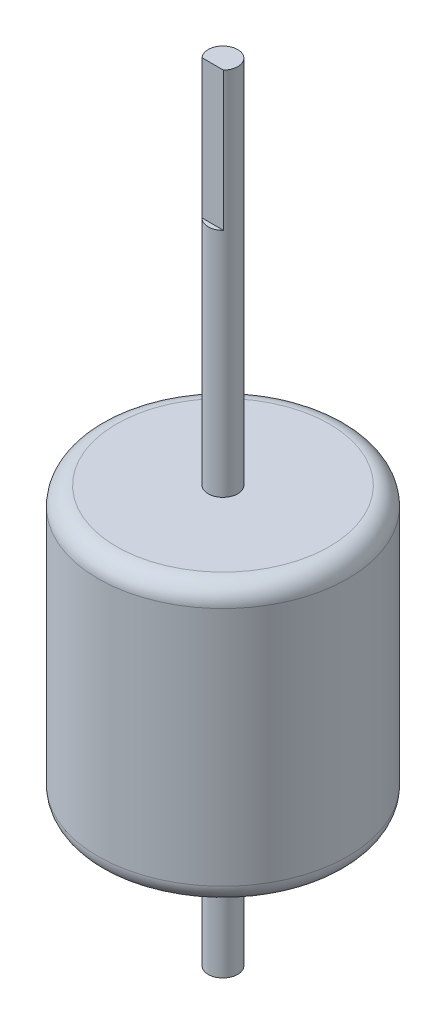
from build123d import *

# Parameters (mm, degrees)
ENL_V_MAT_EXTRU_1_DEPTH                   = 15
TROU_TARAUD_M31_D                         = 2.5
TROU_TARAUD_M31_DEPTH                     = 8.5
TROU_TARAUD_M31_TIP                       = 0.751075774
ESQUISSE5_W                               = 0.7
ESQUISSE5_H                               = 3.8
BOSS_EXTRU_1_DEPTH                        = 6.7
CHANFREIN1_SIZE                           = 1
ESQUISSE6_R                               = 0.8
ENL_V_MAT_EXTRU_2_DEPTH                   = 6.7
R_P_TITION_CIRCULAIRE1_COUNT              = 2
CHANFREIN1_OF_R_P_TITION_CIRCULAIRE1_SIZE = 1
ENL_V_MAT_EXTRU_4_DEPTH                   = 90.145947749
ENL_V_MAT_EXTRU_4_DEPTH_BACK              = 90.145947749
ESQUISSE7_R                               = 19
ESQUISSE7_R_2                             = 1.6


with BuildPart() as part:
    # Esquisse1 → R_volution1 (revolve)
    with BuildSketch(Plane.XY, mode=Mode.PRIVATE) as r_volution1_sk:
        with BuildLine():
            Line((0, 0), (-1.6, 0))
            Line((-1.6, 0), (-1.6, 2.6))
            Line((-1.6, 2.6), (-5.075, 2.6))
            Line((-5.075, 2.6), (-5.075, 4.5))
            Line((-5.075, 4.5), (-19, 4.5))
            Line((-19, 4.5), (-19, 58))
            Line((-19, 58), (-17.85, 58))
            Line((-17.85, 58), (-17.85, 60))
            ThreePointArc((-17.85, 60), (-17.410660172, 61.060660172), (-16.35, 61.5))
            Line((-16.35, 61.5), (-6.5, 61.5))
            Line((-6.5, 61.5), (-6.5, 65.8))
            Line((-6.5, 65.8), (-1.6, 65.8))
            Line((-1.6, 65.8), (-1.6, 85))
            Line((-1.6, 85), (0, 85))
            Line((0, 85), (0, 0))
        make_face()
    revolve(r_volution1_sk.sketch.rotate(Axis((0, 0, 0), (0, 1, 0)), 270), axis=Axis((0, 0, 0), (0, 1, 0)))

    # Esquisse2 → Enl_v. mat.-Extru.1 (cut)
    with BuildSketch(Plane(origin=(0, 85, 0), x_dir=(1, 0, 0), z_dir=(0, 1, 0))):
        with BuildLine():
            Line((-1.161895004, -1.1), (1.161895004, -1.1))
            ThreePointArc((1.161895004, -1.1), (0, -1.6), (-1.161895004, -1.1))
        make_face()
    extrude(amount=-ENL_V_MAT_EXTRU_1_DEPTH, mode=Mode.SUBTRACT)

    # Trou taraud_ M31
    with Locations(Plane(origin=(0, 61.5, 0), x_dir=(-1, 0, 0), z_dir=(0, 1, 0))):
        with Locations((12.5, 0), (-12.5, 0)):
            Hole(TROU_TARAUD_M31_D / 2, depth=TROU_TARAUD_M31_DEPTH)
            with Locations((0, 0, -(TROU_TARAUD_M31_DEPTH + TROU_TARAUD_M31_TIP / 2))):  # 118° drill point
                Cone(0, TROU_TARAUD_M31_D / 2, TROU_TARAUD_M31_TIP, mode=Mode.SUBTRACT)

    # Esquisse5 → Boss.-Extru.1 (add)
    with BuildSketch(Plane.XZ.offset(-4.5)):
        with Locations((-13.95, 0)):
            Rectangle(ESQUISSE5_W, ESQUISSE5_H)
    boss_extru_1 = extrude(amount=BOSS_EXTRU_1_DEPTH)

    # Chanfrein1
    chanfrein1_edges = [part.edges().sort_by_distance(p)[0] for p in [
        (-13.95, -2.2, -1.9),
        (-13.95, -2.2, 1.9),
    ]]
    chamfer(chanfrein1_edges, length=CHANFREIN1_SIZE)

    # Esquisse6 → Enl_v. mat.-Extru.2 (cut)
    with BuildSketch(Plane.ZY.offset(14.3)):
        Circle(ESQUISSE6_R)
    enl_v_mat_extru_2 = extrude(amount=-ENL_V_MAT_EXTRU_2_DEPTH, mode=Mode.SUBTRACT)

    # R_p_tition circulaire1: Boss.-Extru.1, Enl_v. mat.-Extru.2 ×2 about axis
    r_p_tition_circulaire1_axis = Axis((0, 0, 0), (0, 1, 0))
    add([boss_extru_1.rotate(r_p_tition_circulaire1_axis, i * 360 / R_P_TITION_CIRCULAIRE1_COUNT) for i in range(1, R_P_TITION_CIRCULAIRE1_COUNT)])
    add([enl_v_mat_extru_2.rotate(r_p_tition_circulaire1_axis, i * 360 / R_P_TITION_CIRCULAIRE1_COUNT) for i in range(1, R_P_TITION_CIRCULAIRE1_COUNT)], mode=Mode.SUBTRACT)

    # Chanfrein1 of R_p_tition circulaire1
    chanfrein1_of_r_p_tition_circulaire1_edges = [part.edges().sort_by_distance(p)[0] for p in [
        (13.95, -2.2, 1.9),
        (13.95, -2.2, -1.9),
    ]]
    chamfer(chanfrein1_of_r_p_tition_circulaire1_edges, length=CHANFREIN1_OF_R_P_TITION_CIRCULAIRE1_SIZE)

    # Esquisse7 → Enl_v. mat.-Extru.4 (cut, two sides: drawn at the far end of the back side and taken through both)
    with BuildSketch(Plane.XZ.offset(-ENL_V_MAT_EXTRU_4_DEPTH_BACK)):
        Circle(ESQUISSE7_R)
        with Locations(Location((0, 0, 0), (0, 0, 270))):
            Circle(ESQUISSE7_R_2, mode=Mode.SUBTRACT)
    extrude(amount=ENL_V_MAT_EXTRU_4_DEPTH + ENL_V_MAT_EXTRU_4_DEPTH_BACK, mode=Mode.SUBTRACT)

    # Esquisse9 → R_volution2 (revolve)
    with BuildSketch(Plane.XY, mode=Mode.PRIVATE) as r_volution2_sk:
        with BuildLine():
            Line((0, 15), (11.5, 15))
            ThreePointArc((11.5, 15), (12.914213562, 15.585786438), (13.5, 17))
            Line((13.5, 17), (13.5, 43))
            ThreePointArc((13.5, 43), (12.914213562, 44.414213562), (11.5, 45))
            Line((11.5, 45), (0, 45))
            Line((0, 45), (0, 44.5))
            Line((0, 44.5), (10, 44.5))
            Line((10, 44.5), (10, 15.5))
            Line((10, 15.5), (0, 15.5))
            Line((0, 15.5), (0, 15))
        make_face()
    revolve(r_volution2_sk.sketch.rotate(Axis((0, 0, 0), (0, 1, 0)), 90), axis=Axis((0, 0, 0), (0, 1, 0)))


solid = part.part
